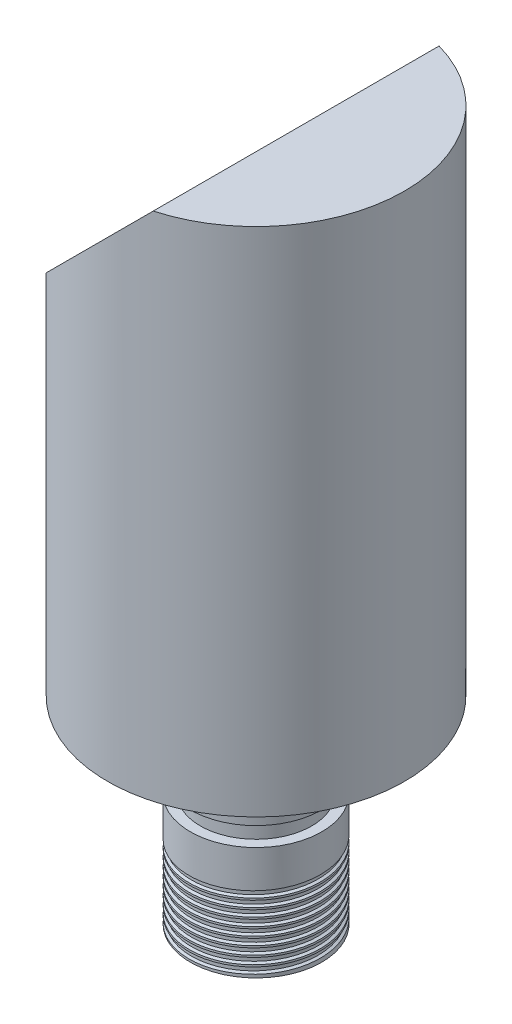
from build123d import *

# Parameters (mm, degrees)
CUT_EXTRUDE1_DEPTH             = 38.1
CUT_SWEEP3_PITCH               = 1
CUT_SWEEP3_HEIGHT              = 9
CUT_SWEEP3_RADIUS              = 8
CUT_SWEEP3_START_ANGLE         = -90
F_3_8_3_8_DIAMETER_HOLE1_D     = 3.8
F_3_8_3_8_DIAMETER_HOLE1_DEPTH = 0.508
F_3_8_3_8_DIAMETER_HOLE1_TIP   = 1.141635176
SKETCH8_R                      = 7.208
CUT_EXTRUDE2_DEPTH             = 12.7


with BuildPart() as part:
    # Sketch1 → Revolve1 (revolve)
    with BuildSketch(Plane.XY, mode=Mode.PRIVATE) as revolve1_sk:
        Polygon((0, 62), (0, -24), (-7.97, -24), (-7.97, -10.3), (-6.75, -10.3), (-6.75, -8), (-7.97, -8), (-7.97, -6.3), (-6.75, -6.3), (-6.75, -4), (-7.97, -4), (-7.97, 0), (-18, 0), (-18, 62), align=None)
    revolve(revolve1_sk.sketch.rotate(Axis((0, 0, 0), (0, 1, 0)), 270), axis=Axis((0, 0, 0), (0, 1, 0)))

    # Sketch2 → Cut-Extrude1 (cut, symmetric)
    with BuildSketch(Plane.XY):
        Polygon((4.86, 62), (-18, 39.14), (-18, 62), align=None)
    extrude(amount=CUT_EXTRUDE1_DEPTH, both=True, mode=Mode.SUBTRACT)

    # Cut-Sweep3: sweep along a helix
    with BuildLine() as cut_sweep3_path:
        add(Helix(CUT_SWEEP3_PITCH, CUT_SWEEP3_HEIGHT, CUT_SWEEP3_RADIUS, center=(0, -24, 0), direction=(0, 1, 0), mode=Mode.PRIVATE).rotate(Axis((0, -24, 0), (0, 1, 0)), CUT_SWEEP3_START_ANGLE))
    # Sketch4 → Cut-Sweep3 (sweep, cut)
    with BuildSketch(Plane.XY):
        Polygon((-8, -24), (-7.690446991, -23.821279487), (-7.690446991, -23.378720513), (-8, -23.2), align=None)
    sweep(path=cut_sweep3_path.line, is_frenet=True, mode=Mode.SUBTRACT)

    # 3.8 _3.8_ Diameter Hole1
    with Locations(Plane(origin=(0, 0, 0), x_dir=(-1, 0, 0), z_dir=(0, -1, 0))):
        with Locations((11, 0)):
            Hole(F_3_8_3_8_DIAMETER_HOLE1_D / 2, depth=F_3_8_3_8_DIAMETER_HOLE1_DEPTH)
            with Locations((0, 0, -(F_3_8_3_8_DIAMETER_HOLE1_DEPTH + F_3_8_3_8_DIAMETER_HOLE1_TIP / 2))):  # 118° drill point
                Cone(0, F_3_8_3_8_DIAMETER_HOLE1_D / 2, F_3_8_3_8_DIAMETER_HOLE1_TIP, mode=Mode.SUBTRACT)

    # Sketch8 → Cut-Extrude2 (cut)
    with BuildSketch(Plane.XZ.offset(24)):
        with Locations(Location((0, 0, 0), (0, 0, 270))):
            Circle(SKETCH8_R)
        with BuildLine():
            Line((-5.592459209, 1.016), (5.592459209, 1.016))
            ThreePointArc((5.592459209, 1.016), (0, 5.684), (-5.592459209, 1.016))
        make_face(mode=Mode.SUBTRACT)
    extrude(amount=-CUT_EXTRUDE2_DEPTH, mode=Mode.SUBTRACT)


solid = part.part
